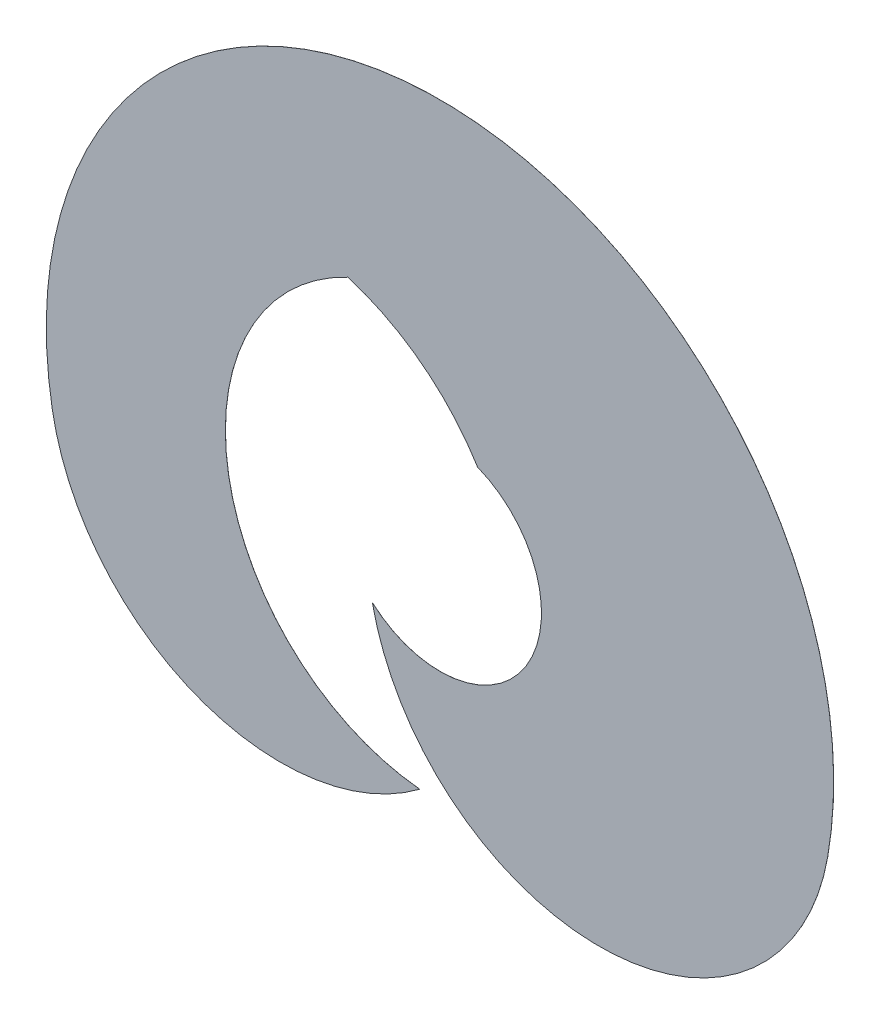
ISO-10303-21;
HEADER;
FILE_DESCRIPTION(('STEP AP214'),'2;1');
FILE_NAME('part.step','',(''),(''),'','','');
FILE_SCHEMA(('AUTOMOTIVE_DESIGN { 1 0 10303 214 1 1 1 1 }'));
ENDSEC;
DATA;
#1=APPLICATION_CONTEXT('core data for automotive mechanical design processes');
#2=APPLICATION_PROTOCOL_DEFINITION('international standard','automotive_design',2000,#1);
#3=PRODUCT_CONTEXT('',#1,'mechanical');
#4=PRODUCT('Part','Part','',(#3));
#5=PRODUCT_RELATED_PRODUCT_CATEGORY('part','',(#4));
#6=PRODUCT_DEFINITION_FORMATION('','',#4);
#7=PRODUCT_DEFINITION_CONTEXT('part definition',#1,'design');
#8=PRODUCT_DEFINITION('design','',#6,#7);
#9=PRODUCT_DEFINITION_SHAPE('','',#8);
#10=(LENGTH_UNIT() NAMED_UNIT(*) SI_UNIT(.MILLI.,.METRE.));
#11=(NAMED_UNIT(*) PLANE_ANGLE_UNIT() SI_UNIT($,.RADIAN.));
#12=(NAMED_UNIT(*) SI_UNIT($,.STERADIAN.) SOLID_ANGLE_UNIT());
#13=UNCERTAINTY_MEASURE_WITH_UNIT(LENGTH_MEASURE(1.E-05),#10,'distance_accuracy_value','');
#14=(GEOMETRIC_REPRESENTATION_CONTEXT(3) GLOBAL_UNCERTAINTY_ASSIGNED_CONTEXT((#13)) GLOBAL_UNIT_ASSIGNED_CONTEXT((#10,
#11,#12)) REPRESENTATION_CONTEXT('',''));
#15=CARTESIAN_POINT('',(0.,0.,0.));
#16=DIRECTION('',(0.,0.,1.));
#17=DIRECTION('',(1.,0.,0.));
#18=AXIS2_PLACEMENT_3D('',#15,#16,#17);
#19=CARTESIAN_POINT('',(250.,607.,0.5));
#20=DIRECTION('',(0.,0.,-1.));
#21=DIRECTION('',(-1.,0.,0.));
#22=AXIS2_PLACEMENT_3D('',#19,#20,#21);
#23=CYLINDRICAL_SURFACE('',#22,1552.03227191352);
#24=CARTESIAN_POINT('',(250.,607.,0.));
#25=DIRECTION('',(0.,0.,-1.));
#26=DIRECTION('',(1.,0.,0.));
#27=AXIS2_PLACEMENT_3D('',#24,#25,#26);
#28=CIRCLE('',#27,1552.03227191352);
#29=CARTESIAN_POINT('',(103.480009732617,-938.100665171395,0.));
#30=VERTEX_POINT('',#29);
#31=CARTESIAN_POINT('',(-416.139304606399,2008.80690536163,0.));
#32=VERTEX_POINT('',#31);
#33=EDGE_CURVE('E115',#30,#32,#28,.T.);
#34=ORIENTED_EDGE('',*,*,#33,.T.);
#35=DIRECTION('',(0.,0.,-1.));
#36=VECTOR('',#35,1.);
#37=CARTESIAN_POINT('',(-416.139304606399,2008.80690536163,0.5));
#38=LINE('',#37,#36);
#39=CARTESIAN_POINT('',(-416.139304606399,2008.80690536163,0.5));
#40=VERTEX_POINT('',#39);
#41=EDGE_CURVE('E11',#40,#32,#38,.T.);
#42=ORIENTED_EDGE('',*,*,#41,.F.);
#43=CARTESIAN_POINT('',(250.,607.,0.5));
#44=DIRECTION('',(0.,0.,-1.));
#45=DIRECTION('',(1.,0.,0.));
#46=AXIS2_PLACEMENT_3D('',#43,#44,#45);
#47=CIRCLE('',#46,1552.03227191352);
#48=CARTESIAN_POINT('',(103.480009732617,-938.100665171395,0.5));
#49=VERTEX_POINT('',#48);
#50=EDGE_CURVE('E126',#49,#40,#47,.T.);
#51=ORIENTED_EDGE('',*,*,#50,.F.);
#52=DIRECTION('',(0.,0.,-1.));
#53=VECTOR('',#52,1.);
#54=CARTESIAN_POINT('',(103.480009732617,-938.100665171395,0.5));
#55=LINE('',#54,#53);
#56=EDGE_CURVE('E111',#49,#30,#55,.T.);
#57=ORIENTED_EDGE('',*,*,#56,.T.);
#58=EDGE_LOOP('',(#34,#42,#51,#57));
#59=FACE_BOUND('',#58,.T.);
#60=ADVANCED_FACE('F32',(#59),#23,.F.);
#61=CARTESIAN_POINT('',(-902.225071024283,403.831632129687,0.5));
#62=DIRECTION('',(0.,0.,-1.));
#63=DIRECTION('',(-1.,0.,0.));
#64=AXIS2_PLACEMENT_3D('',#61,#62,#63);
#65=CYLINDRICAL_SURFACE('',#64,1676.96899196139);
#66=CARTESIAN_POINT('',(-902.225071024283,403.831632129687,0.));
#67=DIRECTION('',(0.,0.,-1.));
#68=DIRECTION('',(1.,0.,0.));
#69=AXIS2_PLACEMENT_3D('',#66,#67,#68);
#70=CIRCLE('',#69,1676.96899196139);
#71=CARTESIAN_POINT('',(522.253742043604,1288.75259533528,0.));
#72=VERTEX_POINT('',#71);
#73=EDGE_CURVE('E118',#32,#72,#70,.T.);
#74=ORIENTED_EDGE('',*,*,#73,.T.);
#75=DIRECTION('',(0.,0.,-1.));
#76=VECTOR('',#75,1.);
#77=CARTESIAN_POINT('',(522.253742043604,1288.75259533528,0.5));
#78=LINE('',#77,#76);
#79=CARTESIAN_POINT('',(522.253742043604,1288.75259533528,0.5));
#80=VERTEX_POINT('',#79);
#81=EDGE_CURVE('E40',#80,#72,#78,.T.);
#82=ORIENTED_EDGE('',*,*,#81,.F.);
#83=CARTESIAN_POINT('',(-902.225071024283,403.831632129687,0.5));
#84=DIRECTION('',(0.,0.,-1.));
#85=DIRECTION('',(1.,0.,0.));
#86=AXIS2_PLACEMENT_3D('',#83,#84,#85);
#87=CIRCLE('',#86,1676.96899196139);
#88=EDGE_CURVE('E85',#40,#80,#87,.T.);
#89=ORIENTED_EDGE('',*,*,#88,.F.);
#90=ORIENTED_EDGE('',*,*,#41,.T.);
#91=EDGE_LOOP('',(#74,#82,#89,#90));
#92=FACE_BOUND('',#91,.T.);
#93=ADVANCED_FACE('F150',(#92),#65,.F.);
#94=CARTESIAN_POINT('',(250.,607.,0.5));
#95=DIRECTION('',(0.,0.,-1.));
#96=DIRECTION('',(-1.,0.,0.));
#97=AXIS2_PLACEMENT_3D('',#94,#95,#96);
#98=CYLINDRICAL_SURFACE('',#97,734.10401259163);
#99=CARTESIAN_POINT('',(250.,607.,0.));
#100=DIRECTION('',(0.,0.,-1.));
#101=DIRECTION('',(1.,0.,0.));
#102=AXIS2_PLACEMENT_3D('',#99,#100,#101);
#103=CIRCLE('',#102,734.10401259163);
#104=CARTESIAN_POINT('',(-239.007952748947,59.4783808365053,0.));
#105=VERTEX_POINT('',#104);
#106=EDGE_CURVE('E120',#72,#105,#103,.T.);
#107=ORIENTED_EDGE('',*,*,#106,.T.);
#108=DIRECTION('',(0.,0.,-1.));
#109=VECTOR('',#108,1.);
#110=CARTESIAN_POINT('',(-239.007952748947,59.4783808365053,0.5));
#111=LINE('',#110,#109);
#112=CARTESIAN_POINT('',(-239.007952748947,59.4783808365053,0.5));
#113=VERTEX_POINT('',#112);
#114=EDGE_CURVE('E106',#113,#105,#111,.T.);
#115=ORIENTED_EDGE('',*,*,#114,.F.);
#116=CARTESIAN_POINT('',(250.,607.,0.5));
#117=DIRECTION('',(0.,0.,-1.));
#118=DIRECTION('',(1.,0.,0.));
#119=AXIS2_PLACEMENT_3D('',#116,#117,#118);
#120=CIRCLE('',#119,734.10401259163);
#121=EDGE_CURVE('E98',#80,#113,#120,.T.);
#122=ORIENTED_EDGE('',*,*,#121,.F.);
#123=ORIENTED_EDGE('',*,*,#81,.T.);
#124=EDGE_LOOP('',(#107,#115,#122,#123));
#125=FACE_BOUND('',#124,.T.);
#126=ADVANCED_FACE('F132',(#125),#98,.F.);
#127=CARTESIAN_POINT('',(1402.22507102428,403.831632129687,0.5));
#128=DIRECTION('',(0.,0.,-1.));
#129=DIRECTION('',(-1.,0.,0.));
#130=AXIS2_PLACEMENT_3D('',#127,#128,#129);
#131=CYLINDRICAL_SURFACE('',#130,1676.96899196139);
#132=CARTESIAN_POINT('',(1402.22507102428,403.831632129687,0.));
#133=DIRECTION('',(0.,0.,1.));
#134=DIRECTION('',(1.,0.,0.));
#135=AXIS2_PLACEMENT_3D('',#132,#133,#134);
#136=CIRCLE('',#135,1676.96899196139);
#137=CARTESIAN_POINT('',(3053.71713586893,112.629022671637,0.));
#138=VERTEX_POINT('',#137);
#139=EDGE_CURVE('E105',#105,#138,#136,.T.);
#140=ORIENTED_EDGE('',*,*,#139,.T.);
#141=DIRECTION('',(0.,0.,-1.));
#142=VECTOR('',#141,1.);
#143=CARTESIAN_POINT('',(3053.71713586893,112.629022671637,0.5));
#144=LINE('',#143,#142);
#145=CARTESIAN_POINT('',(3053.71713586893,112.629022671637,0.5));
#146=VERTEX_POINT('',#145);
#147=EDGE_CURVE('E103',#146,#138,#144,.T.);
#148=ORIENTED_EDGE('',*,*,#147,.F.);
#149=CARTESIAN_POINT('',(1402.22507102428,403.831632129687,0.5));
#150=DIRECTION('',(0.,0.,1.));
#151=DIRECTION('',(1.,0.,0.));
#152=AXIS2_PLACEMENT_3D('',#149,#150,#151);
#153=CIRCLE('',#152,1676.96899196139);
#154=EDGE_CURVE('E92',#113,#146,#153,.T.);
#155=ORIENTED_EDGE('',*,*,#154,.F.);
#156=ORIENTED_EDGE('',*,*,#114,.T.);
#157=EDGE_LOOP('',(#140,#148,#155,#156));
#158=FACE_BOUND('',#157,.T.);
#159=ADVANCED_FACE('F104',(#158),#131,.T.);
#160=CARTESIAN_POINT('',(250.,607.,0.5));
#161=DIRECTION('',(0.,0.,-1.));
#162=DIRECTION('',(-1.,0.,0.));
#163=AXIS2_PLACEMENT_3D('',#160,#161,#162);
#164=CYLINDRICAL_SURFACE('',#163,2846.96899196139);
#165=CARTESIAN_POINT('',(250.,607.,0.));
#166=DIRECTION('',(0.,0.,1.));
#167=DIRECTION('',(1.,0.,0.));
#168=AXIS2_PLACEMENT_3D('',#165,#166,#167);
#169=CIRCLE('',#168,2846.96899196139);
#170=CARTESIAN_POINT('',(-2553.71713586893,112.629022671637,0.));
#171=VERTEX_POINT('',#170);
#172=EDGE_CURVE('E71',#138,#171,#169,.T.);
#173=ORIENTED_EDGE('',*,*,#172,.T.);
#174=DIRECTION('',(0.,0.,-1.));
#175=VECTOR('',#174,1.);
#176=CARTESIAN_POINT('',(-2553.71713586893,112.629022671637,0.5));
#177=LINE('',#176,#175);
#178=CARTESIAN_POINT('',(-2553.71713586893,112.629022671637,0.5));
#179=VERTEX_POINT('',#178);
#180=EDGE_CURVE('E107',#179,#171,#177,.T.);
#181=ORIENTED_EDGE('',*,*,#180,.F.);
#182=CARTESIAN_POINT('',(250.,607.,0.5));
#183=DIRECTION('',(0.,0.,1.));
#184=DIRECTION('',(1.,0.,0.));
#185=AXIS2_PLACEMENT_3D('',#182,#183,#184);
#186=CIRCLE('',#185,2846.96899196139);
#187=EDGE_CURVE('E96',#146,#179,#186,.T.);
#188=ORIENTED_EDGE('',*,*,#187,.F.);
#189=ORIENTED_EDGE('',*,*,#147,.T.);
#190=EDGE_LOOP('',(#173,#181,#188,#189));
#191=FACE_BOUND('',#190,.T.);
#192=ADVANCED_FACE('F109',(#191),#164,.T.);
#193=CARTESIAN_POINT('',(-902.225071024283,403.831632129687,0.5));
#194=DIRECTION('',(0.,0.,-1.));
#195=DIRECTION('',(-1.,0.,0.));
#196=AXIS2_PLACEMENT_3D('',#193,#194,#195);
#197=CYLINDRICAL_SURFACE('',#196,1676.96899196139);
#198=CARTESIAN_POINT('',(-902.225071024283,403.831632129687,0.));
#199=DIRECTION('',(0.,0.,1.));
#200=DIRECTION('',(1.,0.,0.));
#201=AXIS2_PLACEMENT_3D('',#198,#199,#200);
#202=CIRCLE('',#201,1676.96899196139);
#203=EDGE_CURVE('E77',#171,#30,#202,.T.);
#204=ORIENTED_EDGE('',*,*,#203,.T.);
#205=ORIENTED_EDGE('',*,*,#56,.F.);
#206=CARTESIAN_POINT('',(-902.225071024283,403.831632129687,0.5));
#207=DIRECTION('',(0.,0.,1.));
#208=DIRECTION('',(1.,0.,0.));
#209=AXIS2_PLACEMENT_3D('',#206,#207,#208);
#210=CIRCLE('',#209,1676.96899196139);
#211=EDGE_CURVE('E48',#179,#49,#210,.T.);
#212=ORIENTED_EDGE('',*,*,#211,.F.);
#213=ORIENTED_EDGE('',*,*,#180,.T.);
#214=EDGE_LOOP('',(#204,#205,#212,#213));
#215=FACE_BOUND('',#214,.T.);
#216=ADVANCED_FACE('F139',(#215),#197,.T.);
#217=CARTESIAN_POINT('',(-326.112535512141,505.415816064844,0.5));
#218=DIRECTION('',(0.,0.,1.));
#219=DIRECTION('',(1.,0.,0.));
#220=AXIS2_PLACEMENT_3D('',#217,#218,#219);
#221=PLANE('',#220);
#222=ORIENTED_EDGE('',*,*,#50,.T.);
#223=ORIENTED_EDGE('',*,*,#88,.T.);
#224=ORIENTED_EDGE('',*,*,#121,.T.);
#225=ORIENTED_EDGE('',*,*,#154,.T.);
#226=ORIENTED_EDGE('',*,*,#187,.T.);
#227=ORIENTED_EDGE('',*,*,#211,.T.);
#228=EDGE_LOOP('',(#222,#223,#224,#225,#226,#227));
#229=FACE_BOUND('',#228,.T.);
#230=ADVANCED_FACE('F94',(#229),#221,.T.);
#231=CARTESIAN_POINT('',(-326.112535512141,505.415816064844,0.));
#232=DIRECTION('',(0.,0.,1.));
#233=DIRECTION('',(1.,0.,0.));
#234=AXIS2_PLACEMENT_3D('',#231,#232,#233);
#235=PLANE('',#234);
#236=ORIENTED_EDGE('',*,*,#33,.F.);
#237=ORIENTED_EDGE('',*,*,#203,.F.);
#238=ORIENTED_EDGE('',*,*,#172,.F.);
#239=ORIENTED_EDGE('',*,*,#139,.F.);
#240=ORIENTED_EDGE('',*,*,#106,.F.);
#241=ORIENTED_EDGE('',*,*,#73,.F.);
#242=EDGE_LOOP('',(#236,#237,#238,#239,#240,#241));
#243=FACE_BOUND('',#242,.T.);
#244=ADVANCED_FACE('F135',(#243),#235,.F.);
#245=CLOSED_SHELL('',(#60,#93,#126,#159,#192,#216,#230,#244));
#246=MANIFOLD_SOLID_BREP('B2',#245);
#247=ADVANCED_BREP_SHAPE_REPRESENTATION('',(#18,#246),#14);
#248=SHAPE_DEFINITION_REPRESENTATION(#9,#247);
ENDSEC;
END-ISO-10303-21;
